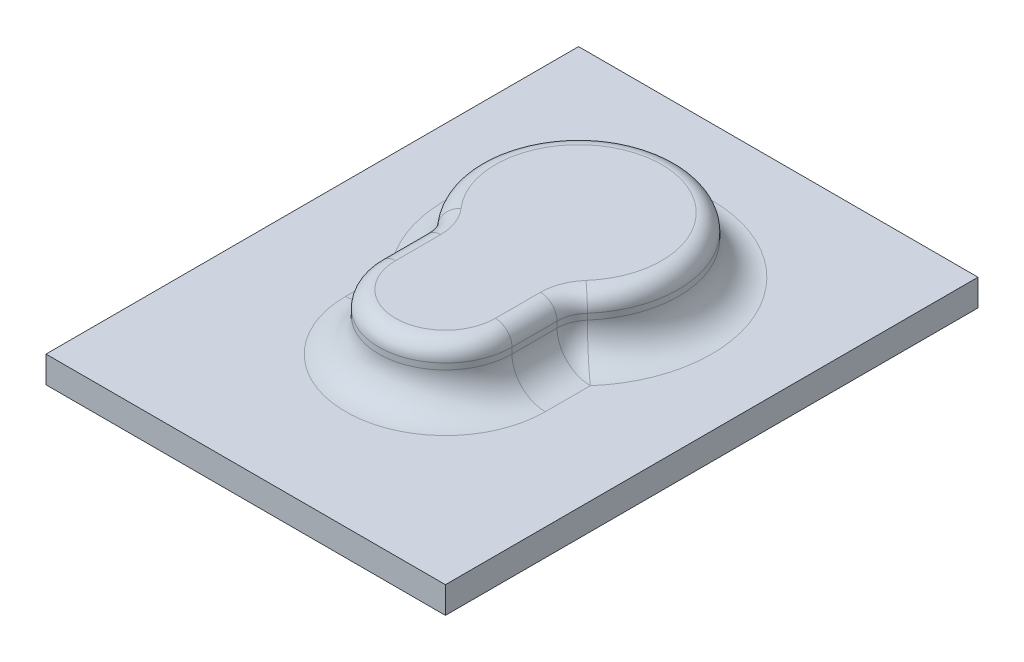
ISO-10303-21;
HEADER;
FILE_DESCRIPTION(('STEP AP214'),'2;1');
FILE_NAME('part.step','',(''),(''),'','','');
FILE_SCHEMA(('AUTOMOTIVE_DESIGN { 1 0 10303 214 1 1 1 1 }'));
ENDSEC;
DATA;
#1=APPLICATION_CONTEXT('core data for automotive mechanical design processes');
#2=APPLICATION_PROTOCOL_DEFINITION('international standard','automotive_design',2000,#1);
#3=PRODUCT_CONTEXT('',#1,'mechanical');
#4=PRODUCT('Part','Part','',(#3));
#5=PRODUCT_RELATED_PRODUCT_CATEGORY('part','',(#4));
#6=PRODUCT_DEFINITION_FORMATION('','',#4);
#7=PRODUCT_DEFINITION_CONTEXT('part definition',#1,'design');
#8=PRODUCT_DEFINITION('design','',#6,#7);
#9=PRODUCT_DEFINITION_SHAPE('','',#8);
#10=(LENGTH_UNIT() NAMED_UNIT(*) SI_UNIT(.MILLI.,.METRE.));
#11=(NAMED_UNIT(*) PLANE_ANGLE_UNIT() SI_UNIT($,.RADIAN.));
#12=(NAMED_UNIT(*) SI_UNIT($,.STERADIAN.) SOLID_ANGLE_UNIT());
#13=UNCERTAINTY_MEASURE_WITH_UNIT(LENGTH_MEASURE(1.E-05),#10,'distance_accuracy_value','');
#14=(GEOMETRIC_REPRESENTATION_CONTEXT(3) GLOBAL_UNCERTAINTY_ASSIGNED_CONTEXT((#13)) GLOBAL_UNIT_ASSIGNED_CONTEXT((#10,
#11,#12)) REPRESENTATION_CONTEXT('',''));
#15=CARTESIAN_POINT('',(0.,0.,0.));
#16=DIRECTION('',(0.,0.,1.));
#17=DIRECTION('',(1.,0.,0.));
#18=AXIS2_PLACEMENT_3D('',#15,#16,#17);
#19=CARTESIAN_POINT('',(-19.05,2.54,-19.05));
#20=DIRECTION('',(1.,0.,0.));
#21=DIRECTION('',(0.,0.,-1.));
#22=AXIS2_PLACEMENT_3D('',#19,#20,#21);
#23=PLANE('',#22);
#24=DIRECTION('',(0.,0.,1.));
#25=VECTOR('',#24,1.);
#26=CARTESIAN_POINT('',(-19.05,0.,-19.05));
#27=LINE('',#26,#25);
#28=CARTESIAN_POINT('',(-19.05,0.,-19.05));
#29=VERTEX_POINT('',#28);
#30=CARTESIAN_POINT('',(-19.05,0.,31.75));
#31=VERTEX_POINT('',#30);
#32=EDGE_CURVE('E163',#29,#31,#27,.T.);
#33=ORIENTED_EDGE('',*,*,#32,.T.);
#34=DIRECTION('',(0.,-1.,0.));
#35=VECTOR('',#34,1.);
#36=CARTESIAN_POINT('',(-19.05,2.54,31.75));
#37=LINE('',#36,#35);
#38=CARTESIAN_POINT('',(-19.05,2.54,31.75));
#39=VERTEX_POINT('',#38);
#40=EDGE_CURVE('E144',#39,#31,#37,.T.);
#41=ORIENTED_EDGE('',*,*,#40,.F.);
#42=DIRECTION('',(0.,0.,1.));
#43=VECTOR('',#42,1.);
#44=CARTESIAN_POINT('',(-19.05,2.54,-19.05));
#45=LINE('',#44,#43);
#46=CARTESIAN_POINT('',(-19.05,2.54,-19.05));
#47=VERTEX_POINT('',#46);
#48=EDGE_CURVE('E151',#47,#39,#45,.T.);
#49=ORIENTED_EDGE('',*,*,#48,.F.);
#50=DIRECTION('',(0.,-1.,0.));
#51=VECTOR('',#50,1.);
#52=CARTESIAN_POINT('',(-19.05,2.54,-19.05));
#53=LINE('',#52,#51);
#54=EDGE_CURVE('E301',#47,#29,#53,.T.);
#55=ORIENTED_EDGE('',*,*,#54,.T.);
#56=EDGE_LOOP('',(#33,#41,#49,#55));
#57=FACE_BOUND('',#56,.T.);
#58=ADVANCED_FACE('F32',(#57),#23,.F.);
#59=CARTESIAN_POINT('',(19.05,2.54,31.75));
#60=DIRECTION('',(0.,0.,-1.));
#61=DIRECTION('',(-1.,0.,0.));
#62=AXIS2_PLACEMENT_3D('',#59,#60,#61);
#63=PLANE('',#62);
#64=DIRECTION('',(1.,0.,0.));
#65=VECTOR('',#64,1.);
#66=CARTESIAN_POINT('',(19.05,0.,31.75));
#67=LINE('',#66,#65);
#68=CARTESIAN_POINT('',(19.05,0.,31.75));
#69=VERTEX_POINT('',#68);
#70=EDGE_CURVE('E303',#31,#69,#67,.T.);
#71=ORIENTED_EDGE('',*,*,#70,.T.);
#72=DIRECTION('',(0.,-1.,0.));
#73=VECTOR('',#72,1.);
#74=CARTESIAN_POINT('',(19.05,2.54,31.75));
#75=LINE('',#74,#73);
#76=CARTESIAN_POINT('',(19.05,2.54,31.75));
#77=VERTEX_POINT('',#76);
#78=EDGE_CURVE('E147',#77,#69,#75,.T.);
#79=ORIENTED_EDGE('',*,*,#78,.F.);
#80=DIRECTION('',(1.,0.,0.));
#81=VECTOR('',#80,1.);
#82=CARTESIAN_POINT('',(19.05,2.54,31.75));
#83=LINE('',#82,#81);
#84=EDGE_CURVE('E140',#39,#77,#83,.T.);
#85=ORIENTED_EDGE('',*,*,#84,.F.);
#86=ORIENTED_EDGE('',*,*,#40,.T.);
#87=EDGE_LOOP('',(#71,#79,#85,#86));
#88=FACE_BOUND('',#87,.T.);
#89=ADVANCED_FACE('F142',(#88),#63,.F.);
#90=CARTESIAN_POINT('',(19.05,2.54,-19.05));
#91=DIRECTION('',(-1.,0.,0.));
#92=DIRECTION('',(0.,0.,1.));
#93=AXIS2_PLACEMENT_3D('',#90,#91,#92);
#94=PLANE('',#93);
#95=DIRECTION('',(0.,0.,-1.));
#96=VECTOR('',#95,1.);
#97=CARTESIAN_POINT('',(19.05,0.,-19.05));
#98=LINE('',#97,#96);
#99=CARTESIAN_POINT('',(19.05,0.,-19.05));
#100=VERTEX_POINT('',#99);
#101=EDGE_CURVE('E305',#69,#100,#98,.T.);
#102=ORIENTED_EDGE('',*,*,#101,.T.);
#103=DIRECTION('',(0.,-1.,0.));
#104=VECTOR('',#103,1.);
#105=CARTESIAN_POINT('',(19.05,2.54,-19.05));
#106=LINE('',#105,#104);
#107=CARTESIAN_POINT('',(19.05,2.54,-19.05));
#108=VERTEX_POINT('',#107);
#109=EDGE_CURVE('E169',#108,#100,#106,.T.);
#110=ORIENTED_EDGE('',*,*,#109,.F.);
#111=DIRECTION('',(0.,0.,-1.));
#112=VECTOR('',#111,1.);
#113=CARTESIAN_POINT('',(19.05,2.54,-19.05));
#114=LINE('',#113,#112);
#115=EDGE_CURVE('E150',#77,#108,#114,.T.);
#116=ORIENTED_EDGE('',*,*,#115,.F.);
#117=ORIENTED_EDGE('',*,*,#78,.T.);
#118=EDGE_LOOP('',(#102,#110,#116,#117));
#119=FACE_BOUND('',#118,.T.);
#120=ADVANCED_FACE('F317',(#119),#94,.F.);
#121=CARTESIAN_POINT('',(19.05,2.54,-19.05));
#122=DIRECTION('',(0.,0.,1.));
#123=DIRECTION('',(1.,0.,0.));
#124=AXIS2_PLACEMENT_3D('',#121,#122,#123);
#125=PLANE('',#124);
#126=DIRECTION('',(-1.,0.,0.));
#127=VECTOR('',#126,1.);
#128=CARTESIAN_POINT('',(19.05,0.,-19.05));
#129=LINE('',#128,#127);
#130=EDGE_CURVE('E160',#100,#29,#129,.T.);
#131=ORIENTED_EDGE('',*,*,#130,.T.);
#132=ORIENTED_EDGE('',*,*,#54,.F.);
#133=DIRECTION('',(-1.,0.,0.));
#134=VECTOR('',#133,1.);
#135=CARTESIAN_POINT('',(19.05,2.54,-19.05));
#136=LINE('',#135,#134);
#137=EDGE_CURVE('E156',#108,#47,#136,.T.);
#138=ORIENTED_EDGE('',*,*,#137,.F.);
#139=ORIENTED_EDGE('',*,*,#109,.T.);
#140=EDGE_LOOP('',(#131,#132,#138,#139));
#141=FACE_BOUND('',#140,.T.);
#142=ADVANCED_FACE('F312',(#141),#125,.F.);
#143=CARTESIAN_POINT('',(0.,2.54,0.));
#144=DIRECTION('',(0.,-1.,0.));
#145=DIRECTION('',(0.,0.,-1.));
#146=AXIS2_PLACEMENT_3D('',#143,#144,#145);
#147=PLANE('',#146);
#148=CARTESIAN_POINT('',(0.,2.54,12.7));
#149=DIRECTION('',(0.,-1.,0.));
#150=DIRECTION('',(0.,0.,-1.));
#151=AXIS2_PLACEMENT_3D('',#148,#149,#150);
#152=CIRCLE('',#151,9.525);
#153=CARTESIAN_POINT('',(9.525,2.54,12.7));
#154=VERTEX_POINT('',#153);
#155=CARTESIAN_POINT('',(-9.525,2.54,12.7));
#156=VERTEX_POINT('',#155);
#157=EDGE_CURVE('E167',#154,#156,#152,.T.);
#158=ORIENTED_EDGE('',*,*,#157,.T.);
#159=DIRECTION('',(0.,0.,1.));
#160=VECTOR('',#159,1.);
#161=CARTESIAN_POINT('',(-9.525,2.54,8.40026041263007));
#162=LINE('',#161,#160);
#163=CARTESIAN_POINT('',(-9.525,2.54,8.40026041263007));
#164=VERTEX_POINT('',#163);
#165=EDGE_CURVE('E178',#156,#164,#162,.F.);
#166=ORIENTED_EDGE('',*,*,#165,.T.);
#167=CARTESIAN_POINT('',(0.,2.54,0.));
#168=DIRECTION('',(0.,-1.,0.));
#169=DIRECTION('',(0.,0.,-1.));
#170=AXIS2_PLACEMENT_3D('',#167,#168,#169);
#171=CIRCLE('',#170,12.7);
#172=CARTESIAN_POINT('',(9.525,2.54,8.40026041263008));
#173=VERTEX_POINT('',#172);
#174=EDGE_CURVE('E176',#164,#173,#171,.T.);
#175=ORIENTED_EDGE('',*,*,#174,.T.);
#176=DIRECTION('',(0.,0.,-1.));
#177=VECTOR('',#176,1.);
#178=CARTESIAN_POINT('',(9.525,2.54,12.7));
#179=LINE('',#178,#177);
#180=EDGE_CURVE('E174',#173,#154,#179,.F.);
#181=ORIENTED_EDGE('',*,*,#180,.T.);
#182=EDGE_LOOP('',(#158,#166,#175,#181));
#183=FACE_BOUND('',#182,.T.);
#184=ORIENTED_EDGE('',*,*,#48,.T.);
#185=ORIENTED_EDGE('',*,*,#84,.T.);
#186=ORIENTED_EDGE('',*,*,#115,.T.);
#187=ORIENTED_EDGE('',*,*,#137,.T.);
#188=EDGE_LOOP('',(#184,#185,#186,#187));
#189=FACE_BOUND('',#188,.T.);
#190=ADVANCED_FACE('F154',(#183,#189),#147,.F.);
#191=CARTESIAN_POINT('',(0.,0.,0.));
#192=DIRECTION('',(0.,-1.,0.));
#193=DIRECTION('',(0.,0.,-1.));
#194=AXIS2_PLACEMENT_3D('',#191,#192,#193);
#195=PLANE('',#194);
#196=ORIENTED_EDGE('',*,*,#32,.F.);
#197=ORIENTED_EDGE('',*,*,#130,.F.);
#198=ORIENTED_EDGE('',*,*,#101,.F.);
#199=ORIENTED_EDGE('',*,*,#70,.F.);
#200=EDGE_LOOP('',(#196,#197,#198,#199));
#201=FACE_BOUND('',#200,.T.);
#202=ADVANCED_FACE('F316',(#201),#195,.T.);
#203=CARTESIAN_POINT('',(9.525,7.874,8.40026041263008));
#204=DIRECTION('',(0.,-1.,0.));
#205=DIRECTION('',(0.,0.,-1.));
#206=AXIS2_PLACEMENT_3D('',#203,#204,#205);
#207=CYLINDRICAL_SURFACE('',#206,3.175);
#208=DIRECTION('',(0.,-1.,0.));
#209=VECTOR('',#208,1.);
#210=CARTESIAN_POINT('',(7.14375,7.874,6.30019530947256));
#211=LINE('',#210,#209);
#212=CARTESIAN_POINT('',(7.14375,6.2865,6.30019530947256));
#213=VERTEX_POINT('',#212);
#214=CARTESIAN_POINT('',(7.14375,5.715,6.30019530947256));
#215=VERTEX_POINT('',#214);
#216=EDGE_CURVE('E294',#213,#215,#211,.T.);
#217=ORIENTED_EDGE('',*,*,#216,.F.);
#218=CARTESIAN_POINT('',(9.525,6.2865,8.40026041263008));
#219=DIRECTION('',(0.,-1.,0.));
#220=DIRECTION('',(0.,0.,-1.));
#221=AXIS2_PLACEMENT_3D('',#218,#219,#220);
#222=CIRCLE('',#221,3.175);
#223=CARTESIAN_POINT('',(6.35,6.2865,8.40026041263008));
#224=VERTEX_POINT('',#223);
#225=EDGE_CURVE('E56',#213,#224,#222,.F.);
#226=ORIENTED_EDGE('',*,*,#225,.T.);
#227=DIRECTION('',(0.,-1.,0.));
#228=VECTOR('',#227,1.);
#229=CARTESIAN_POINT('',(6.35,7.874,8.40026041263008));
#230=LINE('',#229,#228);
#231=CARTESIAN_POINT('',(6.35,5.715,8.40026041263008));
#232=VERTEX_POINT('',#231);
#233=EDGE_CURVE('E214',#224,#232,#230,.T.);
#234=ORIENTED_EDGE('',*,*,#233,.T.);
#235=CARTESIAN_POINT('',(9.525,5.715,8.40026041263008));
#236=DIRECTION('',(0.,-1.,0.));
#237=DIRECTION('',(0.,0.,-1.));
#238=AXIS2_PLACEMENT_3D('',#235,#236,#237);
#239=CIRCLE('',#238,3.175);
#240=EDGE_CURVE('E187',#232,#215,#239,.T.);
#241=ORIENTED_EDGE('',*,*,#240,.T.);
#242=EDGE_LOOP('',(#217,#226,#234,#241));
#243=FACE_BOUND('',#242,.T.);
#244=ADVANCED_FACE('F433',(#243),#207,.F.);
#245=CARTESIAN_POINT('',(0.,7.874,0.));
#246=DIRECTION('',(0.,-1.,0.));
#247=DIRECTION('',(0.,0.,-1.));
#248=AXIS2_PLACEMENT_3D('',#245,#246,#247);
#249=CYLINDRICAL_SURFACE('',#248,9.525);
#250=DIRECTION('',(0.,-1.,0.));
#251=VECTOR('',#250,1.);
#252=CARTESIAN_POINT('',(-7.14375,7.874,6.30019530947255));
#253=LINE('',#252,#251);
#254=CARTESIAN_POINT('',(-7.14375,6.2865,6.30019530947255));
#255=VERTEX_POINT('',#254);
#256=CARTESIAN_POINT('',(-7.14375,5.715,6.30019530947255));
#257=VERTEX_POINT('',#256);
#258=EDGE_CURVE('E289',#255,#257,#253,.T.);
#259=ORIENTED_EDGE('',*,*,#258,.F.);
#260=CARTESIAN_POINT('',(0.,6.2865,0.));
#261=DIRECTION('',(0.,-1.,0.));
#262=DIRECTION('',(0.,0.,-1.));
#263=AXIS2_PLACEMENT_3D('',#260,#261,#262);
#264=CIRCLE('',#263,9.525);
#265=EDGE_CURVE('E232',#255,#213,#264,.T.);
#266=ORIENTED_EDGE('',*,*,#265,.T.);
#267=ORIENTED_EDGE('',*,*,#216,.T.);
#268=CARTESIAN_POINT('',(0.,5.715,0.));
#269=DIRECTION('',(0.,-1.,0.));
#270=DIRECTION('',(0.,0.,-1.));
#271=AXIS2_PLACEMENT_3D('',#268,#269,#270);
#272=CIRCLE('',#271,9.525);
#273=EDGE_CURVE('E184',#215,#257,#272,.F.);
#274=ORIENTED_EDGE('',*,*,#273,.T.);
#275=EDGE_LOOP('',(#259,#266,#267,#274));
#276=FACE_BOUND('',#275,.T.);
#277=ADVANCED_FACE('F291',(#276),#249,.T.);
#278=CARTESIAN_POINT('',(-9.525,7.874,8.40026041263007));
#279=DIRECTION('',(0.,-1.,0.));
#280=DIRECTION('',(0.,0.,-1.));
#281=AXIS2_PLACEMENT_3D('',#278,#279,#280);
#282=CYLINDRICAL_SURFACE('',#281,3.175);
#283=DIRECTION('',(0.,-1.,0.));
#284=VECTOR('',#283,1.);
#285=CARTESIAN_POINT('',(-6.35,7.874,8.40026041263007));
#286=LINE('',#285,#284);
#287=CARTESIAN_POINT('',(-6.35,6.2865,8.40026041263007));
#288=VERTEX_POINT('',#287);
#289=CARTESIAN_POINT('',(-6.35,5.715,8.40026041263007));
#290=VERTEX_POINT('',#289);
#291=EDGE_CURVE('E276',#288,#290,#286,.T.);
#292=ORIENTED_EDGE('',*,*,#291,.F.);
#293=CARTESIAN_POINT('',(-9.525,6.2865,8.40026041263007));
#294=DIRECTION('',(0.,-1.,0.));
#295=DIRECTION('',(0.,0.,-1.));
#296=AXIS2_PLACEMENT_3D('',#293,#294,#295);
#297=CIRCLE('',#296,3.175);
#298=EDGE_CURVE('E230',#288,#255,#297,.F.);
#299=ORIENTED_EDGE('',*,*,#298,.T.);
#300=ORIENTED_EDGE('',*,*,#258,.T.);
#301=CARTESIAN_POINT('',(-9.525,5.715,8.40026041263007));
#302=DIRECTION('',(0.,-1.,0.));
#303=DIRECTION('',(0.,0.,-1.));
#304=AXIS2_PLACEMENT_3D('',#301,#302,#303);
#305=CIRCLE('',#304,3.175);
#306=EDGE_CURVE('E181',#257,#290,#305,.T.);
#307=ORIENTED_EDGE('',*,*,#306,.T.);
#308=EDGE_LOOP('',(#292,#299,#300,#307));
#309=FACE_BOUND('',#308,.T.);
#310=ADVANCED_FACE('F288',(#309),#282,.F.);
#311=CARTESIAN_POINT('',(-6.35,7.874,8.40026041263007));
#312=DIRECTION('',(1.,0.,0.));
#313=DIRECTION('',(0.,0.,-1.));
#314=AXIS2_PLACEMENT_3D('',#311,#312,#313);
#315=PLANE('',#314);
#316=DIRECTION('',(0.,-1.,0.));
#317=VECTOR('',#316,1.);
#318=CARTESIAN_POINT('',(-6.35,7.874,12.7));
#319=LINE('',#318,#317);
#320=CARTESIAN_POINT('',(-6.35,6.2865,12.7));
#321=VERTEX_POINT('',#320);
#322=CARTESIAN_POINT('',(-6.35,5.715,12.7));
#323=VERTEX_POINT('',#322);
#324=EDGE_CURVE('E269',#321,#323,#319,.T.);
#325=ORIENTED_EDGE('',*,*,#324,.F.);
#326=DIRECTION('',(0.,0.,1.));
#327=VECTOR('',#326,1.);
#328=CARTESIAN_POINT('',(-6.35,6.2865,8.40026041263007));
#329=LINE('',#328,#327);
#330=EDGE_CURVE('E227',#321,#288,#329,.F.);
#331=ORIENTED_EDGE('',*,*,#330,.T.);
#332=ORIENTED_EDGE('',*,*,#291,.T.);
#333=DIRECTION('',(0.,0.,1.));
#334=VECTOR('',#333,1.);
#335=CARTESIAN_POINT('',(-6.35,5.715,12.7));
#336=LINE('',#335,#334);
#337=EDGE_CURVE('E164',#290,#323,#336,.T.);
#338=ORIENTED_EDGE('',*,*,#337,.T.);
#339=EDGE_LOOP('',(#325,#331,#332,#338));
#340=FACE_BOUND('',#339,.T.);
#341=ADVANCED_FACE('F273',(#340),#315,.F.);
#342=CARTESIAN_POINT('',(0.,7.874,12.7));
#343=DIRECTION('',(0.,-1.,0.));
#344=DIRECTION('',(0.,0.,-1.));
#345=AXIS2_PLACEMENT_3D('',#342,#343,#344);
#346=CYLINDRICAL_SURFACE('',#345,6.35);
#347=DIRECTION('',(0.,-1.,0.));
#348=VECTOR('',#347,1.);
#349=CARTESIAN_POINT('',(6.35,7.874,12.7));
#350=LINE('',#349,#348);
#351=CARTESIAN_POINT('',(6.35,6.2865,12.7));
#352=VERTEX_POINT('',#351);
#353=CARTESIAN_POINT('',(6.35,5.715,12.7));
#354=VERTEX_POINT('',#353);
#355=EDGE_CURVE('E270',#352,#354,#350,.T.);
#356=ORIENTED_EDGE('',*,*,#355,.F.);
#357=CARTESIAN_POINT('',(0.,6.2865,12.7));
#358=DIRECTION('',(0.,-1.,0.));
#359=DIRECTION('',(0.,0.,-1.));
#360=AXIS2_PLACEMENT_3D('',#357,#358,#359);
#361=CIRCLE('',#360,6.35);
#362=EDGE_CURVE('E11',#352,#321,#361,.T.);
#363=ORIENTED_EDGE('',*,*,#362,.T.);
#364=ORIENTED_EDGE('',*,*,#324,.T.);
#365=CARTESIAN_POINT('',(0.,5.715,12.7));
#366=DIRECTION('',(0.,-1.,0.));
#367=DIRECTION('',(0.,0.,-1.));
#368=AXIS2_PLACEMENT_3D('',#365,#366,#367);
#369=CIRCLE('',#368,6.35);
#370=EDGE_CURVE('E193',#323,#354,#369,.F.);
#371=ORIENTED_EDGE('',*,*,#370,.T.);
#372=EDGE_LOOP('',(#356,#363,#364,#371));
#373=FACE_BOUND('',#372,.T.);
#374=ADVANCED_FACE('F268',(#373),#346,.T.);
#375=CARTESIAN_POINT('',(6.35,7.874,8.40026041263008));
#376=DIRECTION('',(-1.,0.,0.));
#377=DIRECTION('',(0.,0.,1.));
#378=AXIS2_PLACEMENT_3D('',#375,#376,#377);
#379=PLANE('',#378);
#380=ORIENTED_EDGE('',*,*,#233,.F.);
#381=DIRECTION('',(0.,0.,-1.));
#382=VECTOR('',#381,1.);
#383=CARTESIAN_POINT('',(6.35,6.2865,8.40026041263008));
#384=LINE('',#383,#382);
#385=EDGE_CURVE('E41',#224,#352,#384,.F.);
#386=ORIENTED_EDGE('',*,*,#385,.T.);
#387=ORIENTED_EDGE('',*,*,#355,.T.);
#388=DIRECTION('',(0.,0.,-1.));
#389=VECTOR('',#388,1.);
#390=CARTESIAN_POINT('',(6.35,5.715,8.40026041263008));
#391=LINE('',#390,#389);
#392=EDGE_CURVE('E190',#354,#232,#391,.T.);
#393=ORIENTED_EDGE('',*,*,#392,.T.);
#394=EDGE_LOOP('',(#380,#386,#387,#393));
#395=FACE_BOUND('',#394,.T.);
#396=ADVANCED_FACE('F401',(#395),#379,.F.);
#397=CARTESIAN_POINT('',(9.525,7.874,8.40026041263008));
#398=DIRECTION('',(0.,-1.,0.));
#399=DIRECTION('',(0.,0.,-1.));
#400=AXIS2_PLACEMENT_3D('',#397,#398,#399);
#401=PLANE('',#400);
#402=CARTESIAN_POINT('',(-9.525,7.874,8.40026041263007));
#403=DIRECTION('',(0.,-1.,0.));
#404=DIRECTION('',(0.,0.,-1.));
#405=AXIS2_PLACEMENT_3D('',#402,#403,#404);
#406=CIRCLE('',#405,4.7625);
#407=CARTESIAN_POINT('',(-5.953125,7.874,5.25016275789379));
#408=VERTEX_POINT('',#407);
#409=CARTESIAN_POINT('',(-4.7625,7.874,8.40026041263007));
#410=VERTEX_POINT('',#409);
#411=EDGE_CURVE('E222',#408,#410,#406,.T.);
#412=ORIENTED_EDGE('',*,*,#411,.T.);
#413=DIRECTION('',(0.,0.,1.));
#414=VECTOR('',#413,1.);
#415=CARTESIAN_POINT('',(-4.7625,7.874,8.40026041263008));
#416=LINE('',#415,#414);
#417=CARTESIAN_POINT('',(-4.7625,7.874,12.7));
#418=VERTEX_POINT('',#417);
#419=EDGE_CURVE('E224',#410,#418,#416,.T.);
#420=ORIENTED_EDGE('',*,*,#419,.T.);
#421=CARTESIAN_POINT('',(0.,7.874,12.7));
#422=DIRECTION('',(0.,-1.,0.));
#423=DIRECTION('',(0.,0.,-1.));
#424=AXIS2_PLACEMENT_3D('',#421,#422,#423);
#425=CIRCLE('',#424,4.7625);
#426=CARTESIAN_POINT('',(4.7625,7.874,12.7));
#427=VERTEX_POINT('',#426);
#428=EDGE_CURVE('E196',#418,#427,#425,.F.);
#429=ORIENTED_EDGE('',*,*,#428,.T.);
#430=DIRECTION('',(0.,0.,-1.));
#431=VECTOR('',#430,1.);
#432=CARTESIAN_POINT('',(4.7625,7.874,8.40026041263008));
#433=LINE('',#432,#431);
#434=CARTESIAN_POINT('',(4.7625,7.874,8.40026041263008));
#435=VERTEX_POINT('',#434);
#436=EDGE_CURVE('E216',#427,#435,#433,.T.);
#437=ORIENTED_EDGE('',*,*,#436,.T.);
#438=CARTESIAN_POINT('',(9.525,7.874,8.40026041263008));
#439=DIRECTION('',(0.,-1.,0.));
#440=DIRECTION('',(0.,0.,-1.));
#441=AXIS2_PLACEMENT_3D('',#438,#439,#440);
#442=CIRCLE('',#441,4.7625);
#443=CARTESIAN_POINT('',(5.953125,7.874,5.2501627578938));
#444=VERTEX_POINT('',#443);
#445=EDGE_CURVE('E218',#435,#444,#442,.T.);
#446=ORIENTED_EDGE('',*,*,#445,.T.);
#447=CARTESIAN_POINT('',(0.,7.874,0.));
#448=DIRECTION('',(0.,-1.,0.));
#449=DIRECTION('',(0.,0.,-1.));
#450=AXIS2_PLACEMENT_3D('',#447,#448,#449);
#451=CIRCLE('',#450,7.9375);
#452=EDGE_CURVE('E220',#444,#408,#451,.F.);
#453=ORIENTED_EDGE('',*,*,#452,.T.);
#454=EDGE_LOOP('',(#412,#420,#429,#437,#446,#453));
#455=FACE_BOUND('',#454,.T.);
#456=ADVANCED_FACE('F354',(#455),#401,.F.);
#457=CARTESIAN_POINT('',(9.525,5.715,8.40026041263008));
#458=DIRECTION('',(0.,-1.,0.));
#459=DIRECTION('',(0.,0.,-1.));
#460=AXIS2_PLACEMENT_3D('',#457,#458,#459);
#461=SPHERICAL_SURFACE('',#460,3.175);
#462=CARTESIAN_POINT('',(9.525,5.715,8.40026041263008));
#463=DIRECTION('',(0.,0.,-1.));
#464=DIRECTION('',(-1.,0.,0.));
#465=AXIS2_PLACEMENT_3D('',#462,#463,#464);
#466=CIRCLE('',#465,3.175);
#467=EDGE_CURVE('E208',#173,#232,#466,.T.);
#468=ORIENTED_EDGE('',*,*,#467,.F.);
#469=CARTESIAN_POINT('',(9.525,5.715,8.40026041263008));
#470=DIRECTION('',(-0.661437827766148,0.,0.75));
#471=DIRECTION('',(0.75,0.,0.661437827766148));
#472=AXIS2_PLACEMENT_3D('',#469,#470,#471);
#473=CIRCLE('',#472,3.175);
#474=EDGE_CURVE('E211',#215,#173,#473,.T.);
#475=ORIENTED_EDGE('',*,*,#474,.F.);
#476=ORIENTED_EDGE('',*,*,#240,.F.);
#477=EDGE_LOOP('',(#468,#475,#476));
#478=FACE_BOUND('',#477,.T.);
#479=ADVANCED_FACE('F350',(#478),#461,.F.);
#480=CARTESIAN_POINT('',(0.,5.715,0.));
#481=DIRECTION('',(0.,-1.,0.));
#482=DIRECTION('',(0.,0.,-1.));
#483=AXIS2_PLACEMENT_3D('',#480,#481,#482);
#484=TOROIDAL_SURFACE('',#483,12.7,3.175);
#485=ORIENTED_EDGE('',*,*,#474,.T.);
#486=ORIENTED_EDGE('',*,*,#174,.F.);
#487=CARTESIAN_POINT('',(-9.525,5.715,8.40026041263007));
#488=DIRECTION('',(-0.661437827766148,0.,-0.75));
#489=DIRECTION('',(-0.75,0.,0.661437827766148));
#490=AXIS2_PLACEMENT_3D('',#487,#488,#489);
#491=CIRCLE('',#490,3.175);
#492=EDGE_CURVE('E205',#257,#164,#491,.T.);
#493=ORIENTED_EDGE('',*,*,#492,.F.);
#494=ORIENTED_EDGE('',*,*,#273,.F.);
#495=EDGE_LOOP('',(#485,#486,#493,#494));
#496=FACE_BOUND('',#495,.T.);
#497=ADVANCED_FACE('F346',(#496),#484,.F.);
#498=CARTESIAN_POINT('',(9.525,5.715,8.40026041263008));
#499=DIRECTION('',(0.,0.,1.));
#500=DIRECTION('',(1.,0.,0.));
#501=AXIS2_PLACEMENT_3D('',#498,#499,#500);
#502=CYLINDRICAL_SURFACE('',#501,3.175);
#503=ORIENTED_EDGE('',*,*,#467,.T.);
#504=ORIENTED_EDGE('',*,*,#392,.F.);
#505=CARTESIAN_POINT('',(9.525,5.715,12.7));
#506=DIRECTION('',(0.,0.,-1.));
#507=DIRECTION('',(-1.,0.,0.));
#508=AXIS2_PLACEMENT_3D('',#505,#506,#507);
#509=CIRCLE('',#508,3.175);
#510=EDGE_CURVE('E202',#154,#354,#509,.T.);
#511=ORIENTED_EDGE('',*,*,#510,.F.);
#512=ORIENTED_EDGE('',*,*,#180,.F.);
#513=EDGE_LOOP('',(#503,#504,#511,#512));
#514=FACE_BOUND('',#513,.T.);
#515=ADVANCED_FACE('F342',(#514),#502,.F.);
#516=CARTESIAN_POINT('',(-9.525,5.715,8.40026041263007));
#517=DIRECTION('',(0.,-1.,0.));
#518=DIRECTION('',(0.,0.,-1.));
#519=AXIS2_PLACEMENT_3D('',#516,#517,#518);
#520=SPHERICAL_SURFACE('',#519,3.175);
#521=ORIENTED_EDGE('',*,*,#306,.F.);
#522=ORIENTED_EDGE('',*,*,#492,.T.);
#523=CARTESIAN_POINT('',(-9.525,5.715,8.40026041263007));
#524=DIRECTION('',(0.,0.,-1.));
#525=DIRECTION('',(-1.,0.,0.));
#526=AXIS2_PLACEMENT_3D('',#523,#524,#525);
#527=CIRCLE('',#526,3.175);
#528=EDGE_CURVE('E200',#290,#164,#527,.T.);
#529=ORIENTED_EDGE('',*,*,#528,.F.);
#530=EDGE_LOOP('',(#521,#522,#529));
#531=FACE_BOUND('',#530,.T.);
#532=ADVANCED_FACE('F338',(#531),#520,.F.);
#533=CARTESIAN_POINT('',(0.,5.715,12.7));
#534=DIRECTION('',(0.,-1.,0.));
#535=DIRECTION('',(0.,0.,-1.));
#536=AXIS2_PLACEMENT_3D('',#533,#534,#535);
#537=TOROIDAL_SURFACE('',#536,9.525,3.175);
#538=ORIENTED_EDGE('',*,*,#510,.T.);
#539=ORIENTED_EDGE('',*,*,#370,.F.);
#540=CARTESIAN_POINT('',(-9.525,5.715,12.7));
#541=DIRECTION('',(0.,0.,1.));
#542=DIRECTION('',(1.,0.,0.));
#543=AXIS2_PLACEMENT_3D('',#540,#541,#542);
#544=CIRCLE('',#543,3.175);
#545=EDGE_CURVE('E197',#156,#323,#544,.T.);
#546=ORIENTED_EDGE('',*,*,#545,.F.);
#547=ORIENTED_EDGE('',*,*,#157,.F.);
#548=EDGE_LOOP('',(#538,#539,#546,#547));
#549=FACE_BOUND('',#548,.T.);
#550=ADVANCED_FACE('F334',(#549),#537,.F.);
#551=CARTESIAN_POINT('',(-9.525,5.715,8.40026041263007));
#552=DIRECTION('',(0.,0.,-1.));
#553=DIRECTION('',(-1.,0.,0.));
#554=AXIS2_PLACEMENT_3D('',#551,#552,#553);
#555=CYLINDRICAL_SURFACE('',#554,3.175);
#556=ORIENTED_EDGE('',*,*,#528,.T.);
#557=ORIENTED_EDGE('',*,*,#165,.F.);
#558=ORIENTED_EDGE('',*,*,#545,.T.);
#559=ORIENTED_EDGE('',*,*,#337,.F.);
#560=EDGE_LOOP('',(#556,#557,#558,#559));
#561=FACE_BOUND('',#560,.T.);
#562=ADVANCED_FACE('F331',(#561),#555,.F.);
#563=CARTESIAN_POINT('',(9.525,6.2865,8.40026041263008));
#564=DIRECTION('',(0.,-1.,0.));
#565=DIRECTION('',(0.,0.,-1.));
#566=AXIS2_PLACEMENT_3D('',#563,#564,#565);
#567=TOROIDAL_SURFACE('',#566,4.7625,1.5875);
#568=CARTESIAN_POINT('',(4.7625,6.2865,8.40026041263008));
#569=DIRECTION('',(0.,0.,1.));
#570=DIRECTION('',(1.,0.,0.));
#571=AXIS2_PLACEMENT_3D('',#568,#569,#570);
#572=CIRCLE('',#571,1.5875);
#573=EDGE_CURVE('E245',#224,#435,#572,.T.);
#574=ORIENTED_EDGE('',*,*,#573,.F.);
#575=ORIENTED_EDGE('',*,*,#225,.F.);
#576=CARTESIAN_POINT('',(5.953125,6.2865,5.2501627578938));
#577=DIRECTION('',(0.661437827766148,0.,-0.75));
#578=DIRECTION('',(-0.75,0.,-0.661437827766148));
#579=AXIS2_PLACEMENT_3D('',#576,#577,#578);
#580=CIRCLE('',#579,1.5875);
#581=EDGE_CURVE('E36',#444,#213,#580,.T.);
#582=ORIENTED_EDGE('',*,*,#581,.F.);
#583=ORIENTED_EDGE('',*,*,#445,.F.);
#584=EDGE_LOOP('',(#574,#575,#582,#583));
#585=FACE_BOUND('',#584,.T.);
#586=ADVANCED_FACE('F34',(#585),#567,.T.);
#587=CARTESIAN_POINT('',(0.,6.2865,0.));
#588=DIRECTION('',(0.,-1.,0.));
#589=DIRECTION('',(0.,0.,-1.));
#590=AXIS2_PLACEMENT_3D('',#587,#588,#589);
#591=TOROIDAL_SURFACE('',#590,7.9375,1.5875);
#592=ORIENTED_EDGE('',*,*,#581,.T.);
#593=ORIENTED_EDGE('',*,*,#265,.F.);
#594=CARTESIAN_POINT('',(-5.953125,6.2865,5.25016275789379));
#595=DIRECTION('',(0.661437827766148,0.,0.75));
#596=DIRECTION('',(0.75,0.,-0.661437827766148));
#597=AXIS2_PLACEMENT_3D('',#594,#595,#596);
#598=CIRCLE('',#597,1.5875);
#599=EDGE_CURVE('E243',#408,#255,#598,.T.);
#600=ORIENTED_EDGE('',*,*,#599,.F.);
#601=ORIENTED_EDGE('',*,*,#452,.F.);
#602=EDGE_LOOP('',(#592,#593,#600,#601));
#603=FACE_BOUND('',#602,.T.);
#604=ADVANCED_FACE('F255',(#603),#591,.T.);
#605=CARTESIAN_POINT('',(4.7625,6.2865,8.40026041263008));
#606=DIRECTION('',(0.,0.,-1.));
#607=DIRECTION('',(-1.,0.,0.));
#608=AXIS2_PLACEMENT_3D('',#605,#606,#607);
#609=CYLINDRICAL_SURFACE('',#608,1.5875);
#610=ORIENTED_EDGE('',*,*,#573,.T.);
#611=ORIENTED_EDGE('',*,*,#436,.F.);
#612=CARTESIAN_POINT('',(4.7625,6.2865,12.7));
#613=DIRECTION('',(0.,0.,1.));
#614=DIRECTION('',(1.,0.,0.));
#615=AXIS2_PLACEMENT_3D('',#612,#613,#614);
#616=CIRCLE('',#615,1.5875);
#617=EDGE_CURVE('E240',#352,#427,#616,.T.);
#618=ORIENTED_EDGE('',*,*,#617,.F.);
#619=ORIENTED_EDGE('',*,*,#385,.F.);
#620=EDGE_LOOP('',(#610,#611,#618,#619));
#621=FACE_BOUND('',#620,.T.);
#622=ADVANCED_FACE('F260',(#621),#609,.T.);
#623=CARTESIAN_POINT('',(-9.525,6.2865,8.40026041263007));
#624=DIRECTION('',(0.,-1.,0.));
#625=DIRECTION('',(0.,0.,-1.));
#626=AXIS2_PLACEMENT_3D('',#623,#624,#625);
#627=TOROIDAL_SURFACE('',#626,4.7625,1.5875);
#628=ORIENTED_EDGE('',*,*,#599,.T.);
#629=ORIENTED_EDGE('',*,*,#298,.F.);
#630=CARTESIAN_POINT('',(-4.7625,6.2865,8.40026041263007));
#631=DIRECTION('',(0.,0.,1.));
#632=DIRECTION('',(1.,0.,0.));
#633=AXIS2_PLACEMENT_3D('',#630,#631,#632);
#634=CIRCLE('',#633,1.5875);
#635=EDGE_CURVE('E238',#410,#288,#634,.T.);
#636=ORIENTED_EDGE('',*,*,#635,.F.);
#637=ORIENTED_EDGE('',*,*,#411,.F.);
#638=EDGE_LOOP('',(#628,#629,#636,#637));
#639=FACE_BOUND('',#638,.T.);
#640=ADVANCED_FACE('F285',(#639),#627,.T.);
#641=CARTESIAN_POINT('',(0.,6.2865,12.7));
#642=DIRECTION('',(0.,-1.,0.));
#643=DIRECTION('',(0.,0.,-1.));
#644=AXIS2_PLACEMENT_3D('',#641,#642,#643);
#645=TOROIDAL_SURFACE('',#644,4.7625,1.5875);
#646=ORIENTED_EDGE('',*,*,#617,.T.);
#647=ORIENTED_EDGE('',*,*,#428,.F.);
#648=CARTESIAN_POINT('',(-4.7625,6.2865,12.7));
#649=DIRECTION('',(0.,0.,-1.));
#650=DIRECTION('',(-1.,0.,0.));
#651=AXIS2_PLACEMENT_3D('',#648,#649,#650);
#652=CIRCLE('',#651,1.5875);
#653=EDGE_CURVE('E236',#321,#418,#652,.T.);
#654=ORIENTED_EDGE('',*,*,#653,.F.);
#655=ORIENTED_EDGE('',*,*,#362,.F.);
#656=EDGE_LOOP('',(#646,#647,#654,#655));
#657=FACE_BOUND('',#656,.T.);
#658=ADVANCED_FACE('F265',(#657),#645,.T.);
#659=CARTESIAN_POINT('',(-4.7625,6.2865,8.40026041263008));
#660=DIRECTION('',(0.,0.,1.));
#661=DIRECTION('',(1.,0.,0.));
#662=AXIS2_PLACEMENT_3D('',#659,#660,#661);
#663=CYLINDRICAL_SURFACE('',#662,1.5875);
#664=ORIENTED_EDGE('',*,*,#635,.T.);
#665=ORIENTED_EDGE('',*,*,#330,.F.);
#666=ORIENTED_EDGE('',*,*,#653,.T.);
#667=ORIENTED_EDGE('',*,*,#419,.F.);
#668=EDGE_LOOP('',(#664,#665,#666,#667));
#669=FACE_BOUND('',#668,.T.);
#670=ADVANCED_FACE('F279',(#669),#663,.T.);
#671=CLOSED_SHELL('',(#58,#89,#120,#142,#190,#202,#244,#277,#310,#341,#374,#396,#456,#479,#497,
#515,#532,#550,#562,#586,#604,#622,#640,#658,#670));
#672=MANIFOLD_SOLID_BREP('B2',#671);
#673=ADVANCED_BREP_SHAPE_REPRESENTATION('',(#18,#672),#14);
#674=SHAPE_DEFINITION_REPRESENTATION(#9,#673);
ENDSEC;
END-ISO-10303-21;
